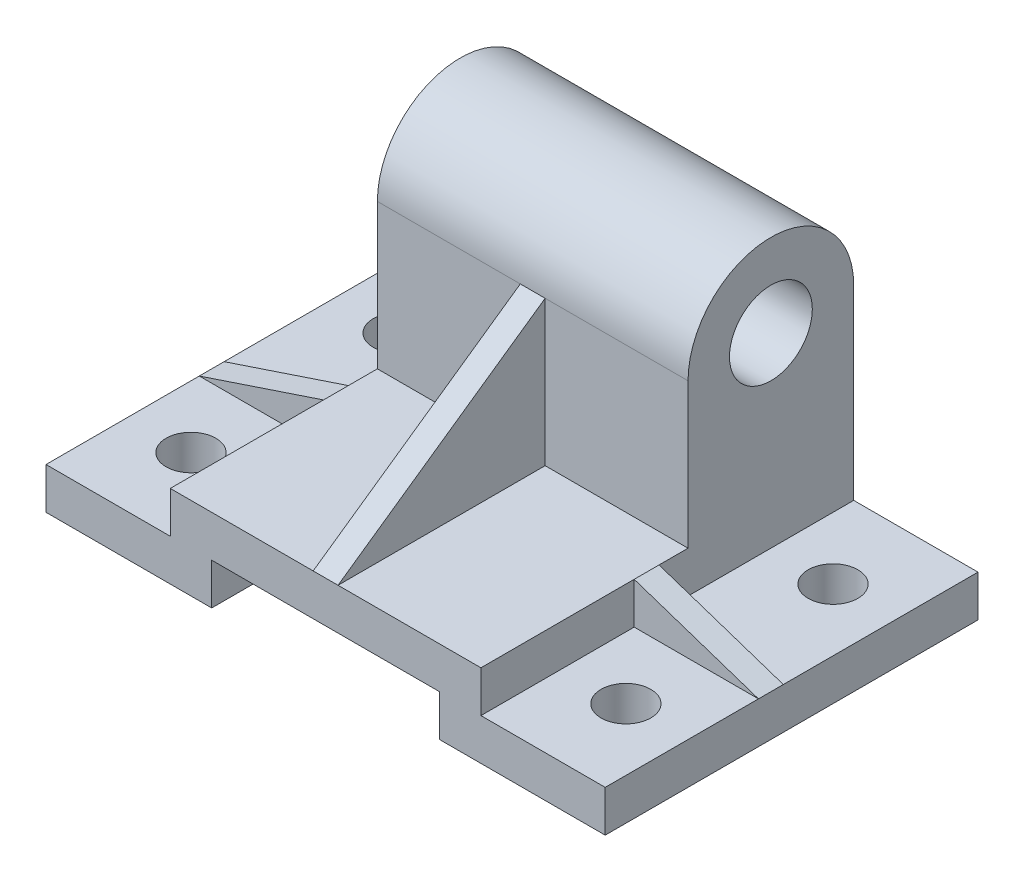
from build123d import *

# Parameters (mm, degrees)
BOSS_EXTRUDE1_DEPTH = 90
SKETCH3_R           = 6
CUT_EXTRUDE1_DEPTH  = 163.55768207
BOSS_EXTRUDE2_DEPTH = 75
SKETCH5_R           = 10
CUT_EXTRUDE2_DEPTH  = 158.321327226
BOSS_EXTRUDE3_DEPTH = 6
BOSS_EXTRUDE4_DEPTH = 6
BOSS_EXTRUDE5_DEPTH = 3


with BuildPart() as part:
    # Sketch2 → Boss-Extrude1 (new body)
    with BuildSketch(Plane.XY):
        Polygon((0, 0), (0, 10), (30, 10), (30, 20), (105, 20), (105, 10), (135, 10), (135, 0), (95, 0), (95, 10), (40, 10), (40, 0), align=None)
    extrude(amount=-BOSS_EXTRUDE1_DEPTH)

    # Sketch3 → Cut-Extrude1 (cut, through all)
    with BuildSketch(Plane(origin=(0, 10, 0), x_dir=(1, 0, 0), z_dir=(0, 1, 0))):
        with Locations(Location((15, 20, 0), (0, 0, 270))):
            Circle(SKETCH3_R)
        with Locations(Location((120, 20, 0), (0, 0, 90))):
            Circle(SKETCH3_R)
        with Locations(Location((15, 70, 0), (0, 0, 90))):
            Circle(SKETCH3_R)
        with Locations(Location((120, 70, 0), (0, 0, 270))):
            Circle(SKETCH3_R)
    extrude(amount=-CUT_EXTRUDE1_DEPTH, mode=Mode.SUBTRACT)

    # Sketch4 → Boss-Extrude2 (add)
    with BuildSketch(Plane.ZY.offset(-30)):
        with BuildLine():
            Line((-90, 55), (-90, 10))
            Line((-90, 10), (-50, 10))
            Line((-50, 10), (-50, 55))
            ThreePointArc((-50, 55), (-70, 75), (-90, 55))
        make_face()
    extrude(amount=-BOSS_EXTRUDE2_DEPTH)

    # Sketch5 → Cut-Extrude2 (cut, through all)
    with BuildSketch(Plane.ZY.offset(-30)):
        with Locations((-70, 55)):
            Circle(SKETCH5_R)
    extrude(amount=-CUT_EXTRUDE2_DEPTH, mode=Mode.SUBTRACT)

    # Sketch6 → Boss-Extrude3 (add)
    with BuildSketch(Plane.XY.offset(-37)):
        Polygon((0, 10), (30, 10), (30, 20), align=None)
    extrude(amount=-BOSS_EXTRUDE3_DEPTH)

    # Sketch7 → Boss-Extrude4 (add)
    with BuildSketch(Plane.XY.offset(-37)):
        Polygon((105, 10), (105, 20), (135, 10), align=None)
    extrude(amount=-BOSS_EXTRUDE4_DEPTH)

    # Sketch8 → Boss-Extrude5 (add, symmetric)
    with BuildSketch(Plane.ZY.offset(-67.5)):
        Polygon((-50, 20), (0, 20), (-50, 55), align=None)
    extrude(amount=BOSS_EXTRUDE5_DEPTH, both=True)


solid = part.part
